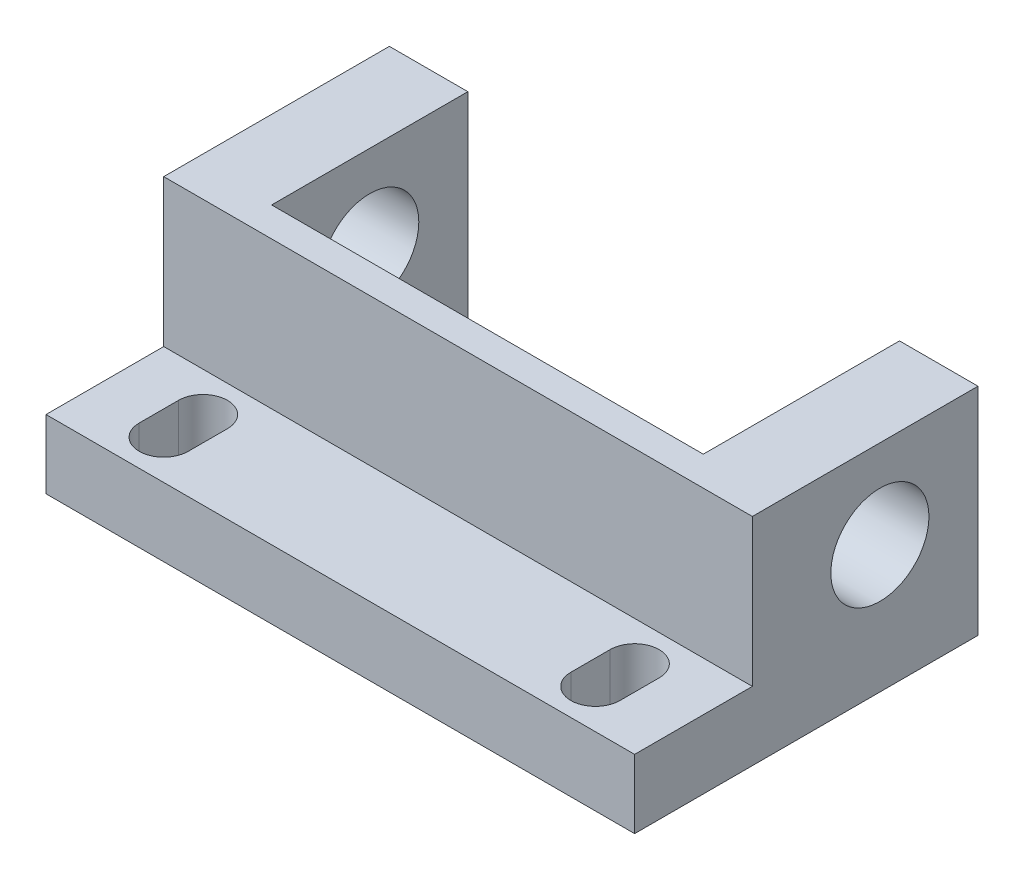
from build123d import *

# Parameters (mm, degrees)
SKETCH1_W           = 35
SKETCH1_H           = 22
BOSS_EXTRUDE1_DEPTH = 30
SKETCH2_W           = 44
SKETCH2_H           = 20
CUT_EXTRUDE1_DEPTH  = 52.078371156
SKETCH3_R           = 5
CUT_EXTRUDE2_DEPTH  = 73.862884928
SKETCH4_W           = 12
SKETCH4_H           = 15
CUT_EXTRUDE3_DEPTH  = 73.862884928
CUT_EXTRUDE4_DEPTH  = 49.476798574


with BuildPart() as part:
    # Sketch1 → Boss-Extrude1 (new, symmetric)
    with BuildSketch(Plane(origin=(0, 0, 0), x_dir=(0, 0, -1), z_dir=(1, 0, 0))):
        with Locations((17.5, 11)):
            Rectangle(SKETCH1_W, SKETCH1_H)
    extrude(amount=BOSS_EXTRUDE1_DEPTH, both=True)

    # Sketch2 → Cut-Extrude1 (cut, through all)
    with BuildSketch(Plane(origin=(0, 22, 0), x_dir=(1, 0, 0), z_dir=(0, 1, 0))):
        with Locations((0, 25)):
            Rectangle(SKETCH2_W, SKETCH2_H)
    extrude(amount=-CUT_EXTRUDE1_DEPTH, mode=Mode.SUBTRACT)

    # Sketch3 → Cut-Extrude2 (cut, through all)
    with BuildSketch(Plane(origin=(30, 0, 0), x_dir=(0, 0, -1), z_dir=(1, 0, 0))):
        with Locations((25, 13)):
            Circle(SKETCH3_R)
    extrude(amount=-CUT_EXTRUDE2_DEPTH, mode=Mode.SUBTRACT)

    # Sketch4 → Cut-Extrude3 (cut, through all)
    with BuildSketch(Plane(origin=(30, 0, 0), x_dir=(0, 0, -1), z_dir=(1, 0, 0))):
        with Locations((6, 14.5)):
            Rectangle(SKETCH4_W, SKETCH4_H)
    extrude(amount=-CUT_EXTRUDE3_DEPTH, mode=Mode.SUBTRACT)

    # Sketch5 → Cut-Extrude4 (cut, through all)
    with BuildSketch(Plane(origin=(0, 7, 0), x_dir=(1, 0, 0), z_dir=(0, 1, 0))):
        with BuildLine():
            Line((-24.5, 4), (-24.5, 8))
            ThreePointArc((-24.5, 8), (-22, 10.5), (-19.5, 8))
            Line((-19.5, 8), (-19.5, 4))
            ThreePointArc((-19.5, 4), (-22, 1.5), (-24.5, 4))
        make_face()
        with BuildLine():
            Line((19.5, 4), (19.5, 8))
            ThreePointArc((19.5, 8), (22, 10.5), (24.5, 8))
            Line((24.5, 8), (24.5, 4))
            ThreePointArc((24.5, 4), (22, 1.5), (19.5, 4))
        make_face()
    extrude(amount=-CUT_EXTRUDE4_DEPTH, mode=Mode.SUBTRACT)


solid = part.part
